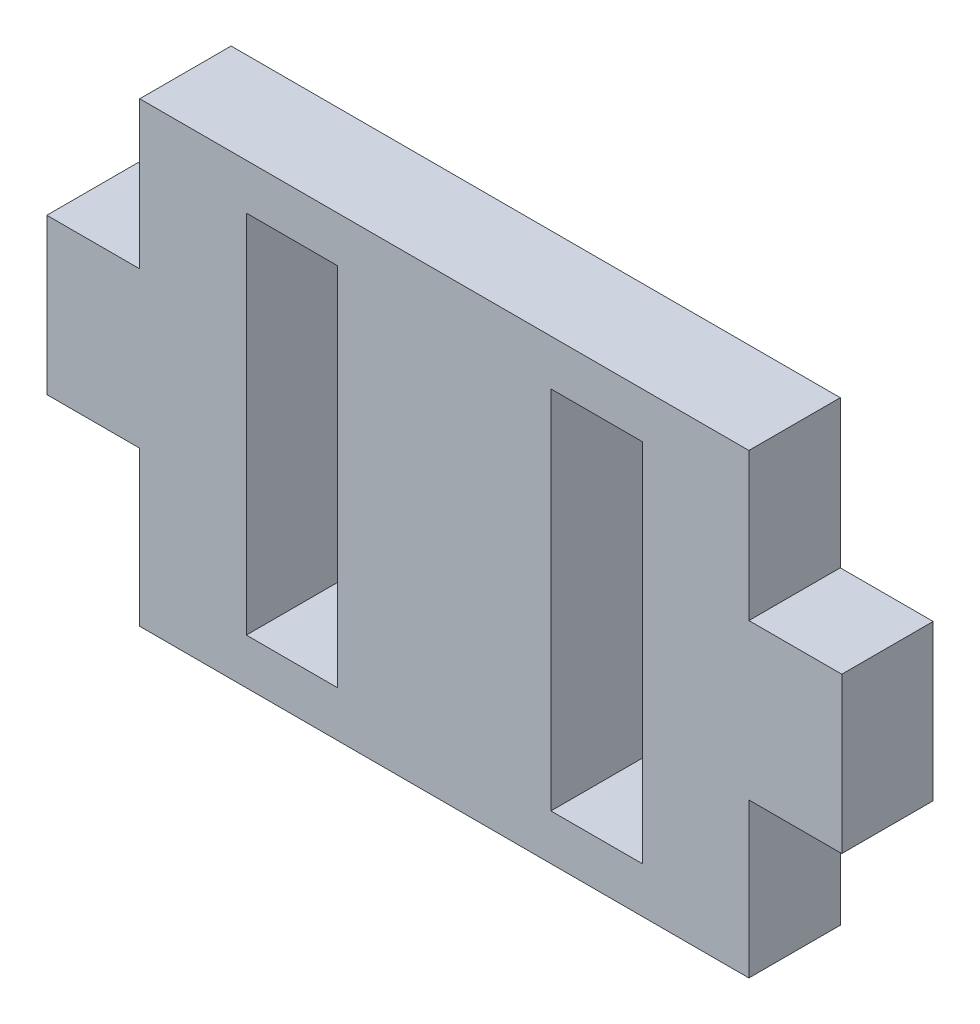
ISO-10303-21;
HEADER;
FILE_DESCRIPTION(('STEP AP214'),'2;1');
FILE_NAME('part.step','',(''),(''),'','','');
FILE_SCHEMA(('AUTOMOTIVE_DESIGN { 1 0 10303 214 1 1 1 1 }'));
ENDSEC;
DATA;
#1=APPLICATION_CONTEXT('core data for automotive mechanical design processes');
#2=APPLICATION_PROTOCOL_DEFINITION('international standard','automotive_design',2000,#1);
#3=PRODUCT_CONTEXT('',#1,'mechanical');
#4=PRODUCT('Part','Part','',(#3));
#5=PRODUCT_RELATED_PRODUCT_CATEGORY('part','',(#4));
#6=PRODUCT_DEFINITION_FORMATION('','',#4);
#7=PRODUCT_DEFINITION_CONTEXT('part definition',#1,'design');
#8=PRODUCT_DEFINITION('design','',#6,#7);
#9=PRODUCT_DEFINITION_SHAPE('','',#8);
#10=(LENGTH_UNIT() NAMED_UNIT(*) SI_UNIT(.MILLI.,.METRE.));
#11=(NAMED_UNIT(*) PLANE_ANGLE_UNIT() SI_UNIT($,.RADIAN.));
#12=(NAMED_UNIT(*) SI_UNIT($,.STERADIAN.) SOLID_ANGLE_UNIT());
#13=UNCERTAINTY_MEASURE_WITH_UNIT(LENGTH_MEASURE(1.E-05),#10,'distance_accuracy_value','');
#14=(GEOMETRIC_REPRESENTATION_CONTEXT(3) GLOBAL_UNCERTAINTY_ASSIGNED_CONTEXT((#13)) GLOBAL_UNIT_ASSIGNED_CONTEXT((#10,
#11,#12)) REPRESENTATION_CONTEXT('',''));
#15=CARTESIAN_POINT('',(0.,0.,0.));
#16=DIRECTION('',(0.,0.,1.));
#17=DIRECTION('',(1.,0.,0.));
#18=AXIS2_PLACEMENT_3D('',#15,#16,#17);
#19=CARTESIAN_POINT('',(0.,0.,6.));
#20=DIRECTION('',(0.,0.,-1.));
#21=DIRECTION('',(-1.,0.,0.));
#22=AXIS2_PLACEMENT_3D('',#19,#20,#21);
#23=PLANE('',#22);
#24=DIRECTION('',(0.,-1.,0.));
#25=VECTOR('',#24,1.);
#26=CARTESIAN_POINT('',(1.09006737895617,9.04398419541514,6.));
#27=LINE('',#26,#25);
#28=CARTESIAN_POINT('',(1.09006737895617,9.04398419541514,6.));
#29=VERTEX_POINT('',#28);
#30=CARTESIAN_POINT('',(1.09006737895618,-14.9560158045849,6.));
#31=VERTEX_POINT('',#30);
#32=EDGE_CURVE('E206',#29,#31,#27,.T.);
#33=ORIENTED_EDGE('',*,*,#32,.F.);
#34=DIRECTION('',(-1.,0.,0.));
#35=VECTOR('',#34,1.);
#36=CARTESIAN_POINT('',(1.09006737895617,9.04398419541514,6.));
#37=LINE('',#36,#35);
#38=CARTESIAN_POINT('',(7.09006737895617,9.04398419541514,6.));
#39=VERTEX_POINT('',#38);
#40=EDGE_CURVE('E214',#39,#29,#37,.T.);
#41=ORIENTED_EDGE('',*,*,#40,.F.);
#42=DIRECTION('',(0.,1.,0.));
#43=VECTOR('',#42,1.);
#44=CARTESIAN_POINT('',(7.09006737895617,9.04398419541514,6.));
#45=LINE('',#44,#43);
#46=CARTESIAN_POINT('',(7.09006737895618,-14.9560158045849,6.));
#47=VERTEX_POINT('',#46);
#48=EDGE_CURVE('E211',#47,#39,#45,.T.);
#49=ORIENTED_EDGE('',*,*,#48,.F.);
#50=DIRECTION('',(1.,0.,0.));
#51=VECTOR('',#50,1.);
#52=CARTESIAN_POINT('',(1.09006737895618,-14.9560158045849,6.));
#53=LINE('',#52,#51);
#54=EDGE_CURVE('E208',#31,#47,#53,.T.);
#55=ORIENTED_EDGE('',*,*,#54,.F.);
#56=EDGE_LOOP('',(#33,#41,#49,#55));
#57=FACE_BOUND('',#56,.T.);
#58=DIRECTION('',(0.,-1.,0.));
#59=VECTOR('',#58,1.);
#60=CARTESIAN_POINT('',(-5.90993262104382,12.0439841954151,6.));
#61=LINE('',#60,#59);
#62=CARTESIAN_POINT('',(-5.90993262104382,12.0439841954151,6.));
#63=VERTEX_POINT('',#62);
#64=CARTESIAN_POINT('',(-5.90993262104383,2.37020213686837,6.));
#65=VERTEX_POINT('',#64);
#66=EDGE_CURVE('E237',#63,#65,#61,.T.);
#67=ORIENTED_EDGE('',*,*,#66,.T.);
#68=DIRECTION('',(-1.,0.,0.));
#69=VECTOR('',#68,1.);
#70=CARTESIAN_POINT('',(-5.90993262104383,2.37020213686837,6.));
#71=LINE('',#70,#69);
#72=CARTESIAN_POINT('',(-12.0099326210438,2.37020213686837,6.));
#73=VERTEX_POINT('',#72);
#74=EDGE_CURVE('E240',#65,#73,#71,.T.);
#75=ORIENTED_EDGE('',*,*,#74,.T.);
#76=DIRECTION('',(0.,-1.,0.));
#77=VECTOR('',#76,1.);
#78=CARTESIAN_POINT('',(-12.0099326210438,2.37020213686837,6.));
#79=LINE('',#78,#77);
#80=CARTESIAN_POINT('',(-12.0099326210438,-7.82979786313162,6.));
#81=VERTEX_POINT('',#80);
#82=EDGE_CURVE('E243',#73,#81,#79,.T.);
#83=ORIENTED_EDGE('',*,*,#82,.T.);
#84=DIRECTION('',(1.,0.,0.));
#85=VECTOR('',#84,1.);
#86=CARTESIAN_POINT('',(-12.0099326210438,-7.82979786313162,6.));
#87=LINE('',#86,#85);
#88=CARTESIAN_POINT('',(-5.90993262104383,-7.82979786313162,6.));
#89=VERTEX_POINT('',#88);
#90=EDGE_CURVE('E245',#81,#89,#87,.T.);
#91=ORIENTED_EDGE('',*,*,#90,.T.);
#92=DIRECTION('',(0.,-1.,0.));
#93=VECTOR('',#92,1.);
#94=CARTESIAN_POINT('',(-5.90993262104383,-7.82979786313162,6.));
#95=LINE('',#94,#93);
#96=CARTESIAN_POINT('',(-5.90993262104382,-17.9560158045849,6.));
#97=VERTEX_POINT('',#96);
#98=EDGE_CURVE('E247',#89,#97,#95,.T.);
#99=ORIENTED_EDGE('',*,*,#98,.T.);
#100=DIRECTION('',(1.,0.,0.));
#101=VECTOR('',#100,1.);
#102=CARTESIAN_POINT('',(-5.90993262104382,-17.9560158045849,6.));
#103=LINE('',#102,#101);
#104=CARTESIAN_POINT('',(34.0900673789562,-17.9560158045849,6.));
#105=VERTEX_POINT('',#104);
#106=EDGE_CURVE('E249',#97,#105,#103,.T.);
#107=ORIENTED_EDGE('',*,*,#106,.T.);
#108=DIRECTION('',(0.,1.,0.));
#109=VECTOR('',#108,1.);
#110=CARTESIAN_POINT('',(34.0900673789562,-7.82979786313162,6.));
#111=LINE('',#110,#109);
#112=CARTESIAN_POINT('',(34.0900673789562,-7.82979786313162,6.));
#113=VERTEX_POINT('',#112);
#114=EDGE_CURVE('E251',#105,#113,#111,.T.);
#115=ORIENTED_EDGE('',*,*,#114,.T.);
#116=DIRECTION('',(1.,0.,0.));
#117=VECTOR('',#116,1.);
#118=CARTESIAN_POINT('',(40.1900673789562,-7.82979786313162,6.));
#119=LINE('',#118,#117);
#120=CARTESIAN_POINT('',(40.1900673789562,-7.82979786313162,6.));
#121=VERTEX_POINT('',#120);
#122=EDGE_CURVE('E253',#113,#121,#119,.T.);
#123=ORIENTED_EDGE('',*,*,#122,.T.);
#124=DIRECTION('',(0.,1.,0.));
#125=VECTOR('',#124,1.);
#126=CARTESIAN_POINT('',(40.1900673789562,2.37020213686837,6.));
#127=LINE('',#126,#125);
#128=CARTESIAN_POINT('',(40.1900673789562,2.37020213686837,6.));
#129=VERTEX_POINT('',#128);
#130=EDGE_CURVE('E255',#121,#129,#127,.T.);
#131=ORIENTED_EDGE('',*,*,#130,.T.);
#132=DIRECTION('',(-1.,0.,0.));
#133=VECTOR('',#132,1.);
#134=CARTESIAN_POINT('',(34.0900673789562,2.37020213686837,6.));
#135=LINE('',#134,#133);
#136=CARTESIAN_POINT('',(34.0900673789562,2.37020213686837,6.));
#137=VERTEX_POINT('',#136);
#138=EDGE_CURVE('E257',#129,#137,#135,.T.);
#139=ORIENTED_EDGE('',*,*,#138,.T.);
#140=DIRECTION('',(0.,1.,0.));
#141=VECTOR('',#140,1.);
#142=CARTESIAN_POINT('',(34.0900673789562,12.0439841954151,6.));
#143=LINE('',#142,#141);
#144=CARTESIAN_POINT('',(34.0900673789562,12.0439841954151,6.));
#145=VERTEX_POINT('',#144);
#146=EDGE_CURVE('E259',#137,#145,#143,.T.);
#147=ORIENTED_EDGE('',*,*,#146,.T.);
#148=DIRECTION('',(-1.,0.,0.));
#149=VECTOR('',#148,1.);
#150=CARTESIAN_POINT('',(-5.90993262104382,12.0439841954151,6.));
#151=LINE('',#150,#149);
#152=EDGE_CURVE('E261',#145,#63,#151,.T.);
#153=ORIENTED_EDGE('',*,*,#152,.T.);
#154=EDGE_LOOP('',(#67,#75,#83,#91,#99,#107,#115,#123,#131,#139,#147,#153));
#155=FACE_BOUND('',#154,.T.);
#156=DIRECTION('',(0.,1.,0.));
#157=VECTOR('',#156,1.);
#158=CARTESIAN_POINT('',(27.0900673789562,9.04398419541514,6.));
#159=LINE('',#158,#157);
#160=CARTESIAN_POINT('',(27.0900673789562,-14.9560158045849,6.));
#161=VERTEX_POINT('',#160);
#162=CARTESIAN_POINT('',(27.0900673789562,9.04398419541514,6.));
#163=VERTEX_POINT('',#162);
#164=EDGE_CURVE('E170',#161,#163,#159,.T.);
#165=ORIENTED_EDGE('',*,*,#164,.F.);
#166=DIRECTION('',(1.,0.,0.));
#167=VECTOR('',#166,1.);
#168=CARTESIAN_POINT('',(27.0900673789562,-14.9560158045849,6.));
#169=LINE('',#168,#167);
#170=CARTESIAN_POINT('',(21.0900673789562,-14.9560158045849,6.));
#171=VERTEX_POINT('',#170);
#172=EDGE_CURVE('E192',#171,#161,#169,.T.);
#173=ORIENTED_EDGE('',*,*,#172,.F.);
#174=DIRECTION('',(0.,-1.,0.));
#175=VECTOR('',#174,1.);
#176=CARTESIAN_POINT('',(21.0900673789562,9.04398419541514,6.));
#177=LINE('',#176,#175);
#178=CARTESIAN_POINT('',(21.0900673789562,9.04398419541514,6.));
#179=VERTEX_POINT('',#178);
#180=EDGE_CURVE('E190',#179,#171,#177,.T.);
#181=ORIENTED_EDGE('',*,*,#180,.F.);
#182=DIRECTION('',(-1.,0.,0.));
#183=VECTOR('',#182,1.);
#184=CARTESIAN_POINT('',(27.0900673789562,9.04398419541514,6.));
#185=LINE('',#184,#183);
#186=EDGE_CURVE('E178',#163,#179,#185,.T.);
#187=ORIENTED_EDGE('',*,*,#186,.F.);
#188=EDGE_LOOP('',(#165,#173,#181,#187));
#189=FACE_BOUND('',#188,.T.);
#190=ADVANCED_FACE('F33',(#57,#155,#189),#23,.F.);
#191=CARTESIAN_POINT('',(0.,0.,0.));
#192=DIRECTION('',(0.,0.,-1.));
#193=DIRECTION('',(-1.,0.,0.));
#194=AXIS2_PLACEMENT_3D('',#191,#192,#193);
#195=PLANE('',#194);
#196=DIRECTION('',(0.,-1.,0.));
#197=VECTOR('',#196,1.);
#198=CARTESIAN_POINT('',(-5.90993262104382,12.0439841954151,0.));
#199=LINE('',#198,#197);
#200=CARTESIAN_POINT('',(-5.90993262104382,12.0439841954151,0.));
#201=VERTEX_POINT('',#200);
#202=CARTESIAN_POINT('',(-5.90993262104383,2.37020213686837,0.));
#203=VERTEX_POINT('',#202);
#204=EDGE_CURVE('E236',#201,#203,#199,.T.);
#205=ORIENTED_EDGE('',*,*,#204,.F.);
#206=DIRECTION('',(-1.,0.,0.));
#207=VECTOR('',#206,1.);
#208=CARTESIAN_POINT('',(-5.90993262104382,12.0439841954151,0.));
#209=LINE('',#208,#207);
#210=CARTESIAN_POINT('',(34.0900673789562,12.0439841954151,0.));
#211=VERTEX_POINT('',#210);
#212=EDGE_CURVE('E241',#211,#201,#209,.T.);
#213=ORIENTED_EDGE('',*,*,#212,.F.);
#214=DIRECTION('',(0.,1.,0.));
#215=VECTOR('',#214,1.);
#216=CARTESIAN_POINT('',(34.0900673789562,12.0439841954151,0.));
#217=LINE('',#216,#215);
#218=CARTESIAN_POINT('',(34.0900673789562,2.37020213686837,0.));
#219=VERTEX_POINT('',#218);
#220=EDGE_CURVE('E284',#219,#211,#217,.T.);
#221=ORIENTED_EDGE('',*,*,#220,.F.);
#222=DIRECTION('',(-1.,0.,0.));
#223=VECTOR('',#222,1.);
#224=CARTESIAN_POINT('',(34.0900673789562,2.37020213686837,0.));
#225=LINE('',#224,#223);
#226=CARTESIAN_POINT('',(40.1900673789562,2.37020213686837,0.));
#227=VERTEX_POINT('',#226);
#228=EDGE_CURVE('E282',#227,#219,#225,.T.);
#229=ORIENTED_EDGE('',*,*,#228,.F.);
#230=DIRECTION('',(0.,1.,0.));
#231=VECTOR('',#230,1.);
#232=CARTESIAN_POINT('',(40.1900673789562,2.37020213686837,0.));
#233=LINE('',#232,#231);
#234=CARTESIAN_POINT('',(40.1900673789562,-7.82979786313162,0.));
#235=VERTEX_POINT('',#234);
#236=EDGE_CURVE('E280',#235,#227,#233,.T.);
#237=ORIENTED_EDGE('',*,*,#236,.F.);
#238=DIRECTION('',(1.,0.,0.));
#239=VECTOR('',#238,1.);
#240=CARTESIAN_POINT('',(40.1900673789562,-7.82979786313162,0.));
#241=LINE('',#240,#239);
#242=CARTESIAN_POINT('',(34.0900673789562,-7.82979786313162,0.));
#243=VERTEX_POINT('',#242);
#244=EDGE_CURVE('E278',#243,#235,#241,.T.);
#245=ORIENTED_EDGE('',*,*,#244,.F.);
#246=DIRECTION('',(0.,1.,0.));
#247=VECTOR('',#246,1.);
#248=CARTESIAN_POINT('',(34.0900673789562,-7.82979786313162,0.));
#249=LINE('',#248,#247);
#250=CARTESIAN_POINT('',(34.0900673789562,-17.9560158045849,0.));
#251=VERTEX_POINT('',#250);
#252=EDGE_CURVE('E276',#251,#243,#249,.T.);
#253=ORIENTED_EDGE('',*,*,#252,.F.);
#254=DIRECTION('',(1.,0.,0.));
#255=VECTOR('',#254,1.);
#256=CARTESIAN_POINT('',(-5.90993262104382,-17.9560158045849,0.));
#257=LINE('',#256,#255);
#258=CARTESIAN_POINT('',(-5.90993262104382,-17.9560158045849,0.));
#259=VERTEX_POINT('',#258);
#260=EDGE_CURVE('E274',#259,#251,#257,.T.);
#261=ORIENTED_EDGE('',*,*,#260,.F.);
#262=DIRECTION('',(0.,-1.,0.));
#263=VECTOR('',#262,1.);
#264=CARTESIAN_POINT('',(-5.90993262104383,-7.82979786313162,0.));
#265=LINE('',#264,#263);
#266=CARTESIAN_POINT('',(-5.90993262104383,-7.82979786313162,0.));
#267=VERTEX_POINT('',#266);
#268=EDGE_CURVE('E272',#267,#259,#265,.T.);
#269=ORIENTED_EDGE('',*,*,#268,.F.);
#270=DIRECTION('',(1.,0.,0.));
#271=VECTOR('',#270,1.);
#272=CARTESIAN_POINT('',(-12.0099326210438,-7.82979786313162,0.));
#273=LINE('',#272,#271);
#274=CARTESIAN_POINT('',(-12.0099326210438,-7.82979786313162,0.));
#275=VERTEX_POINT('',#274);
#276=EDGE_CURVE('E270',#275,#267,#273,.T.);
#277=ORIENTED_EDGE('',*,*,#276,.F.);
#278=DIRECTION('',(0.,-1.,0.));
#279=VECTOR('',#278,1.);
#280=CARTESIAN_POINT('',(-12.0099326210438,2.37020213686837,0.));
#281=LINE('',#280,#279);
#282=CARTESIAN_POINT('',(-12.0099326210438,2.37020213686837,0.));
#283=VERTEX_POINT('',#282);
#284=EDGE_CURVE('E268',#283,#275,#281,.T.);
#285=ORIENTED_EDGE('',*,*,#284,.F.);
#286=DIRECTION('',(-1.,0.,0.));
#287=VECTOR('',#286,1.);
#288=CARTESIAN_POINT('',(-5.90993262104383,2.37020213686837,0.));
#289=LINE('',#288,#287);
#290=EDGE_CURVE('E266',#203,#283,#289,.T.);
#291=ORIENTED_EDGE('',*,*,#290,.F.);
#292=EDGE_LOOP('',(#205,#213,#221,#229,#237,#245,#253,#261,#269,#277,#285,#291));
#293=FACE_BOUND('',#292,.T.);
#294=DIRECTION('',(-1.,0.,0.));
#295=VECTOR('',#294,1.);
#296=CARTESIAN_POINT('',(1.09006737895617,9.04398419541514,0.));
#297=LINE('',#296,#295);
#298=CARTESIAN_POINT('',(7.09006737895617,9.04398419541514,0.));
#299=VERTEX_POINT('',#298);
#300=CARTESIAN_POINT('',(1.09006737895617,9.04398419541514,0.));
#301=VERTEX_POINT('',#300);
#302=EDGE_CURVE('E209',#299,#301,#297,.T.);
#303=ORIENTED_EDGE('',*,*,#302,.T.);
#304=DIRECTION('',(0.,-1.,0.));
#305=VECTOR('',#304,1.);
#306=CARTESIAN_POINT('',(1.09006737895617,9.04398419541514,0.));
#307=LINE('',#306,#305);
#308=CARTESIAN_POINT('',(1.09006737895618,-14.9560158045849,0.));
#309=VERTEX_POINT('',#308);
#310=EDGE_CURVE('E186',#301,#309,#307,.T.);
#311=ORIENTED_EDGE('',*,*,#310,.T.);
#312=DIRECTION('',(1.,0.,0.));
#313=VECTOR('',#312,1.);
#314=CARTESIAN_POINT('',(1.09006737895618,-14.9560158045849,0.));
#315=LINE('',#314,#313);
#316=CARTESIAN_POINT('',(7.09006737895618,-14.9560158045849,0.));
#317=VERTEX_POINT('',#316);
#318=EDGE_CURVE('E219',#309,#317,#315,.T.);
#319=ORIENTED_EDGE('',*,*,#318,.T.);
#320=DIRECTION('',(0.,1.,0.));
#321=VECTOR('',#320,1.);
#322=CARTESIAN_POINT('',(7.09006737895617,9.04398419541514,0.));
#323=LINE('',#322,#321);
#324=EDGE_CURVE('E222',#317,#299,#323,.T.);
#325=ORIENTED_EDGE('',*,*,#324,.T.);
#326=EDGE_LOOP('',(#303,#311,#319,#325));
#327=FACE_BOUND('',#326,.T.);
#328=DIRECTION('',(1.,0.,0.));
#329=VECTOR('',#328,1.);
#330=CARTESIAN_POINT('',(27.0900673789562,-14.9560158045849,0.));
#331=LINE('',#330,#329);
#332=CARTESIAN_POINT('',(21.0900673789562,-14.9560158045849,0.));
#333=VERTEX_POINT('',#332);
#334=CARTESIAN_POINT('',(27.0900673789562,-14.9560158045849,0.));
#335=VERTEX_POINT('',#334);
#336=EDGE_CURVE('E179',#333,#335,#331,.T.);
#337=ORIENTED_EDGE('',*,*,#336,.T.);
#338=DIRECTION('',(0.,1.,0.));
#339=VECTOR('',#338,1.);
#340=CARTESIAN_POINT('',(27.0900673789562,9.04398419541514,0.));
#341=LINE('',#340,#339);
#342=CARTESIAN_POINT('',(27.0900673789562,9.04398419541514,0.));
#343=VERTEX_POINT('',#342);
#344=EDGE_CURVE('E56',#335,#343,#341,.T.);
#345=ORIENTED_EDGE('',*,*,#344,.T.);
#346=DIRECTION('',(-1.,0.,0.));
#347=VECTOR('',#346,1.);
#348=CARTESIAN_POINT('',(27.0900673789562,9.04398419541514,0.));
#349=LINE('',#348,#347);
#350=CARTESIAN_POINT('',(21.0900673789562,9.04398419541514,0.));
#351=VERTEX_POINT('',#350);
#352=EDGE_CURVE('E185',#343,#351,#349,.T.);
#353=ORIENTED_EDGE('',*,*,#352,.T.);
#354=DIRECTION('',(0.,-1.,0.));
#355=VECTOR('',#354,1.);
#356=CARTESIAN_POINT('',(21.0900673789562,9.04398419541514,0.));
#357=LINE('',#356,#355);
#358=EDGE_CURVE('E198',#351,#333,#357,.T.);
#359=ORIENTED_EDGE('',*,*,#358,.T.);
#360=EDGE_LOOP('',(#337,#345,#353,#359));
#361=FACE_BOUND('',#360,.T.);
#362=ADVANCED_FACE('F326',(#293,#327,#361),#195,.T.);
#363=CARTESIAN_POINT('',(-5.90993262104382,12.0439841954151,6.));
#364=DIRECTION('',(1.,0.,0.));
#365=DIRECTION('',(0.,1.,0.));
#366=AXIS2_PLACEMENT_3D('',#363,#364,#365);
#367=PLANE('',#366);
#368=ORIENTED_EDGE('',*,*,#204,.T.);
#369=DIRECTION('',(0.,0.,-1.));
#370=VECTOR('',#369,1.);
#371=CARTESIAN_POINT('',(-5.90993262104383,2.37020213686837,6.));
#372=LINE('',#371,#370);
#373=EDGE_CURVE('E11',#65,#203,#372,.T.);
#374=ORIENTED_EDGE('',*,*,#373,.F.);
#375=ORIENTED_EDGE('',*,*,#66,.F.);
#376=DIRECTION('',(0.,0.,-1.));
#377=VECTOR('',#376,1.);
#378=CARTESIAN_POINT('',(-5.90993262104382,12.0439841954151,6.));
#379=LINE('',#378,#377);
#380=EDGE_CURVE('E263',#63,#201,#379,.T.);
#381=ORIENTED_EDGE('',*,*,#380,.T.);
#382=EDGE_LOOP('',(#368,#374,#375,#381));
#383=FACE_BOUND('',#382,.T.);
#384=ADVANCED_FACE('F35',(#383),#367,.F.);
#385=CARTESIAN_POINT('',(-5.90993262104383,2.37020213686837,6.));
#386=DIRECTION('',(0.,-1.,0.));
#387=DIRECTION('',(1.,0.,0.));
#388=AXIS2_PLACEMENT_3D('',#385,#386,#387);
#389=PLANE('',#388);
#390=ORIENTED_EDGE('',*,*,#290,.T.);
#391=DIRECTION('',(0.,0.,-1.));
#392=VECTOR('',#391,1.);
#393=CARTESIAN_POINT('',(-12.0099326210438,2.37020213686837,6.));
#394=LINE('',#393,#392);
#395=EDGE_CURVE('E41',#73,#283,#394,.T.);
#396=ORIENTED_EDGE('',*,*,#395,.F.);
#397=ORIENTED_EDGE('',*,*,#74,.F.);
#398=ORIENTED_EDGE('',*,*,#373,.T.);
#399=EDGE_LOOP('',(#390,#396,#397,#398));
#400=FACE_BOUND('',#399,.T.);
#401=ADVANCED_FACE('F343',(#400),#389,.F.);
#402=CARTESIAN_POINT('',(-12.0099326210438,2.37020213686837,6.));
#403=DIRECTION('',(1.,0.,0.));
#404=DIRECTION('',(0.,1.,0.));
#405=AXIS2_PLACEMENT_3D('',#402,#403,#404);
#406=PLANE('',#405);
#407=ORIENTED_EDGE('',*,*,#284,.T.);
#408=DIRECTION('',(0.,0.,-1.));
#409=VECTOR('',#408,1.);
#410=CARTESIAN_POINT('',(-12.0099326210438,-7.82979786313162,6.));
#411=LINE('',#410,#409);
#412=EDGE_CURVE('E313',#81,#275,#411,.T.);
#413=ORIENTED_EDGE('',*,*,#412,.F.);
#414=ORIENTED_EDGE('',*,*,#82,.F.);
#415=ORIENTED_EDGE('',*,*,#395,.T.);
#416=EDGE_LOOP('',(#407,#413,#414,#415));
#417=FACE_BOUND('',#416,.T.);
#418=ADVANCED_FACE('F320',(#417),#406,.F.);
#419=CARTESIAN_POINT('',(-12.0099326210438,-7.82979786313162,6.));
#420=DIRECTION('',(0.,1.,0.));
#421=DIRECTION('',(0.,0.,1.));
#422=AXIS2_PLACEMENT_3D('',#419,#420,#421);
#423=PLANE('',#422);
#424=ORIENTED_EDGE('',*,*,#276,.T.);
#425=DIRECTION('',(0.,0.,-1.));
#426=VECTOR('',#425,1.);
#427=CARTESIAN_POINT('',(-5.90993262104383,-7.82979786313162,6.));
#428=LINE('',#427,#426);
#429=EDGE_CURVE('E310',#89,#267,#428,.T.);
#430=ORIENTED_EDGE('',*,*,#429,.F.);
#431=ORIENTED_EDGE('',*,*,#90,.F.);
#432=ORIENTED_EDGE('',*,*,#412,.T.);
#433=EDGE_LOOP('',(#424,#430,#431,#432));
#434=FACE_BOUND('',#433,.T.);
#435=ADVANCED_FACE('F332',(#434),#423,.F.);
#436=CARTESIAN_POINT('',(-5.90993262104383,-7.82979786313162,6.));
#437=DIRECTION('',(1.,0.,0.));
#438=DIRECTION('',(0.,1.,0.));
#439=AXIS2_PLACEMENT_3D('',#436,#437,#438);
#440=PLANE('',#439);
#441=ORIENTED_EDGE('',*,*,#268,.T.);
#442=DIRECTION('',(0.,0.,-1.));
#443=VECTOR('',#442,1.);
#444=CARTESIAN_POINT('',(-5.90993262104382,-17.9560158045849,6.));
#445=LINE('',#444,#443);
#446=EDGE_CURVE('E307',#97,#259,#445,.T.);
#447=ORIENTED_EDGE('',*,*,#446,.F.);
#448=ORIENTED_EDGE('',*,*,#98,.F.);
#449=ORIENTED_EDGE('',*,*,#429,.T.);
#450=EDGE_LOOP('',(#441,#447,#448,#449));
#451=FACE_BOUND('',#450,.T.);
#452=ADVANCED_FACE('F336',(#451),#440,.F.);
#453=CARTESIAN_POINT('',(-5.90993262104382,-17.9560158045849,6.));
#454=DIRECTION('',(0.,1.,0.));
#455=DIRECTION('',(0.,0.,1.));
#456=AXIS2_PLACEMENT_3D('',#453,#454,#455);
#457=PLANE('',#456);
#458=ORIENTED_EDGE('',*,*,#260,.T.);
#459=DIRECTION('',(0.,0.,-1.));
#460=VECTOR('',#459,1.);
#461=CARTESIAN_POINT('',(34.0900673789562,-17.9560158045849,6.));
#462=LINE('',#461,#460);
#463=EDGE_CURVE('E304',#105,#251,#462,.T.);
#464=ORIENTED_EDGE('',*,*,#463,.F.);
#465=ORIENTED_EDGE('',*,*,#106,.F.);
#466=ORIENTED_EDGE('',*,*,#446,.T.);
#467=EDGE_LOOP('',(#458,#464,#465,#466));
#468=FACE_BOUND('',#467,.T.);
#469=ADVANCED_FACE('F376',(#468),#457,.F.);
#470=CARTESIAN_POINT('',(34.0900673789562,-7.82979786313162,6.));
#471=DIRECTION('',(-1.,0.,0.));
#472=DIRECTION('',(0.,-1.,0.));
#473=AXIS2_PLACEMENT_3D('',#470,#471,#472);
#474=PLANE('',#473);
#475=ORIENTED_EDGE('',*,*,#252,.T.);
#476=DIRECTION('',(0.,0.,-1.));
#477=VECTOR('',#476,1.);
#478=CARTESIAN_POINT('',(34.0900673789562,-7.82979786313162,6.));
#479=LINE('',#478,#477);
#480=EDGE_CURVE('E301',#113,#243,#479,.T.);
#481=ORIENTED_EDGE('',*,*,#480,.F.);
#482=ORIENTED_EDGE('',*,*,#114,.F.);
#483=ORIENTED_EDGE('',*,*,#463,.T.);
#484=EDGE_LOOP('',(#475,#481,#482,#483));
#485=FACE_BOUND('',#484,.T.);
#486=ADVANCED_FACE('F374',(#485),#474,.F.);
#487=CARTESIAN_POINT('',(40.1900673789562,-7.82979786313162,6.));
#488=DIRECTION('',(0.,1.,0.));
#489=DIRECTION('',(0.,0.,1.));
#490=AXIS2_PLACEMENT_3D('',#487,#488,#489);
#491=PLANE('',#490);
#492=ORIENTED_EDGE('',*,*,#244,.T.);
#493=DIRECTION('',(0.,0.,-1.));
#494=VECTOR('',#493,1.);
#495=CARTESIAN_POINT('',(40.1900673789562,-7.82979786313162,6.));
#496=LINE('',#495,#494);
#497=EDGE_CURVE('E298',#121,#235,#496,.T.);
#498=ORIENTED_EDGE('',*,*,#497,.F.);
#499=ORIENTED_EDGE('',*,*,#122,.F.);
#500=ORIENTED_EDGE('',*,*,#480,.T.);
#501=EDGE_LOOP('',(#492,#498,#499,#500));
#502=FACE_BOUND('',#501,.T.);
#503=ADVANCED_FACE('F370',(#502),#491,.F.);
#504=CARTESIAN_POINT('',(40.1900673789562,2.37020213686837,6.));
#505=DIRECTION('',(-1.,0.,0.));
#506=DIRECTION('',(0.,-1.,0.));
#507=AXIS2_PLACEMENT_3D('',#504,#505,#506);
#508=PLANE('',#507);
#509=ORIENTED_EDGE('',*,*,#236,.T.);
#510=DIRECTION('',(0.,0.,-1.));
#511=VECTOR('',#510,1.);
#512=CARTESIAN_POINT('',(40.1900673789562,2.37020213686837,6.));
#513=LINE('',#512,#511);
#514=EDGE_CURVE('E295',#129,#227,#513,.T.);
#515=ORIENTED_EDGE('',*,*,#514,.F.);
#516=ORIENTED_EDGE('',*,*,#130,.F.);
#517=ORIENTED_EDGE('',*,*,#497,.T.);
#518=EDGE_LOOP('',(#509,#515,#516,#517));
#519=FACE_BOUND('',#518,.T.);
#520=ADVANCED_FACE('F365',(#519),#508,.F.);
#521=CARTESIAN_POINT('',(34.0900673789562,2.37020213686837,6.));
#522=DIRECTION('',(0.,-1.,0.));
#523=DIRECTION('',(1.,0.,0.));
#524=AXIS2_PLACEMENT_3D('',#521,#522,#523);
#525=PLANE('',#524);
#526=ORIENTED_EDGE('',*,*,#228,.T.);
#527=DIRECTION('',(0.,0.,-1.));
#528=VECTOR('',#527,1.);
#529=CARTESIAN_POINT('',(34.0900673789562,2.37020213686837,6.));
#530=LINE('',#529,#528);
#531=EDGE_CURVE('E292',#137,#219,#530,.T.);
#532=ORIENTED_EDGE('',*,*,#531,.F.);
#533=ORIENTED_EDGE('',*,*,#138,.F.);
#534=ORIENTED_EDGE('',*,*,#514,.T.);
#535=EDGE_LOOP('',(#526,#532,#533,#534));
#536=FACE_BOUND('',#535,.T.);
#537=ADVANCED_FACE('F359',(#536),#525,.F.);
#538=CARTESIAN_POINT('',(34.0900673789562,12.0439841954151,6.));
#539=DIRECTION('',(-1.,0.,0.));
#540=DIRECTION('',(0.,-1.,0.));
#541=AXIS2_PLACEMENT_3D('',#538,#539,#540);
#542=PLANE('',#541);
#543=ORIENTED_EDGE('',*,*,#220,.T.);
#544=DIRECTION('',(0.,0.,-1.));
#545=VECTOR('',#544,1.);
#546=CARTESIAN_POINT('',(34.0900673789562,12.0439841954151,6.));
#547=LINE('',#546,#545);
#548=EDGE_CURVE('E289',#145,#211,#547,.T.);
#549=ORIENTED_EDGE('',*,*,#548,.F.);
#550=ORIENTED_EDGE('',*,*,#146,.F.);
#551=ORIENTED_EDGE('',*,*,#531,.T.);
#552=EDGE_LOOP('',(#543,#549,#550,#551));
#553=FACE_BOUND('',#552,.T.);
#554=ADVANCED_FACE('F355',(#553),#542,.F.);
#555=CARTESIAN_POINT('',(-5.90993262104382,12.0439841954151,6.));
#556=DIRECTION('',(0.,-1.,0.));
#557=DIRECTION('',(1.,0.,0.));
#558=AXIS2_PLACEMENT_3D('',#555,#556,#557);
#559=PLANE('',#558);
#560=ORIENTED_EDGE('',*,*,#212,.T.);
#561=ORIENTED_EDGE('',*,*,#380,.F.);
#562=ORIENTED_EDGE('',*,*,#152,.F.);
#563=ORIENTED_EDGE('',*,*,#548,.T.);
#564=EDGE_LOOP('',(#560,#561,#562,#563));
#565=FACE_BOUND('',#564,.T.);
#566=ADVANCED_FACE('F350',(#565),#559,.F.);
#567=CARTESIAN_POINT('',(1.09006737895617,9.04398419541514,6.));
#568=DIRECTION('',(1.,0.,0.));
#569=DIRECTION('',(0.,1.,0.));
#570=AXIS2_PLACEMENT_3D('',#567,#568,#569);
#571=PLANE('',#570);
#572=ORIENTED_EDGE('',*,*,#310,.F.);
#573=DIRECTION('',(0.,0.,-1.));
#574=VECTOR('',#573,1.);
#575=CARTESIAN_POINT('',(1.09006737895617,9.04398419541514,6.));
#576=LINE('',#575,#574);
#577=EDGE_CURVE('E216',#29,#301,#576,.T.);
#578=ORIENTED_EDGE('',*,*,#577,.F.);
#579=ORIENTED_EDGE('',*,*,#32,.T.);
#580=DIRECTION('',(0.,0.,-1.));
#581=VECTOR('',#580,1.);
#582=CARTESIAN_POINT('',(1.09006737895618,-14.9560158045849,6.));
#583=LINE('',#582,#581);
#584=EDGE_CURVE('E233',#31,#309,#583,.T.);
#585=ORIENTED_EDGE('',*,*,#584,.T.);
#586=EDGE_LOOP('',(#572,#578,#579,#585));
#587=FACE_BOUND('',#586,.T.);
#588=ADVANCED_FACE('F394',(#587),#571,.T.);
#589=CARTESIAN_POINT('',(1.09006737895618,-14.9560158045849,6.));
#590=DIRECTION('',(0.,1.,0.));
#591=DIRECTION('',(0.,0.,1.));
#592=AXIS2_PLACEMENT_3D('',#589,#590,#591);
#593=PLANE('',#592);
#594=ORIENTED_EDGE('',*,*,#318,.F.);
#595=ORIENTED_EDGE('',*,*,#584,.F.);
#596=ORIENTED_EDGE('',*,*,#54,.T.);
#597=DIRECTION('',(0.,0.,-1.));
#598=VECTOR('',#597,1.);
#599=CARTESIAN_POINT('',(7.09006737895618,-14.9560158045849,6.));
#600=LINE('',#599,#598);
#601=EDGE_CURVE('E231',#47,#317,#600,.T.);
#602=ORIENTED_EDGE('',*,*,#601,.T.);
#603=EDGE_LOOP('',(#594,#595,#596,#602));
#604=FACE_BOUND('',#603,.T.);
#605=ADVANCED_FACE('F432',(#604),#593,.T.);
#606=CARTESIAN_POINT('',(7.09006737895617,9.04398419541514,6.));
#607=DIRECTION('',(-1.,0.,0.));
#608=DIRECTION('',(0.,-1.,0.));
#609=AXIS2_PLACEMENT_3D('',#606,#607,#608);
#610=PLANE('',#609);
#611=ORIENTED_EDGE('',*,*,#324,.F.);
#612=ORIENTED_EDGE('',*,*,#601,.F.);
#613=ORIENTED_EDGE('',*,*,#48,.T.);
#614=DIRECTION('',(0.,0.,-1.));
#615=VECTOR('',#614,1.);
#616=CARTESIAN_POINT('',(7.09006737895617,9.04398419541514,6.));
#617=LINE('',#616,#615);
#618=EDGE_CURVE('E229',#39,#299,#617,.T.);
#619=ORIENTED_EDGE('',*,*,#618,.T.);
#620=EDGE_LOOP('',(#611,#612,#613,#619));
#621=FACE_BOUND('',#620,.T.);
#622=ADVANCED_FACE('F439',(#621),#610,.T.);
#623=CARTESIAN_POINT('',(1.09006737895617,9.04398419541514,6.));
#624=DIRECTION('',(0.,-1.,0.));
#625=DIRECTION('',(0.,0.,-1.));
#626=AXIS2_PLACEMENT_3D('',#623,#624,#625);
#627=PLANE('',#626);
#628=ORIENTED_EDGE('',*,*,#302,.F.);
#629=ORIENTED_EDGE('',*,*,#618,.F.);
#630=ORIENTED_EDGE('',*,*,#40,.T.);
#631=ORIENTED_EDGE('',*,*,#577,.T.);
#632=EDGE_LOOP('',(#628,#629,#630,#631));
#633=FACE_BOUND('',#632,.T.);
#634=ADVANCED_FACE('F446',(#633),#627,.T.);
#635=CARTESIAN_POINT('',(27.0900673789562,9.04398419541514,6.));
#636=DIRECTION('',(-1.,0.,0.));
#637=DIRECTION('',(0.,-1.,0.));
#638=AXIS2_PLACEMENT_3D('',#635,#636,#637);
#639=PLANE('',#638);
#640=ORIENTED_EDGE('',*,*,#344,.F.);
#641=DIRECTION('',(0.,0.,-1.));
#642=VECTOR('',#641,1.);
#643=CARTESIAN_POINT('',(27.0900673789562,-14.9560158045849,6.));
#644=LINE('',#643,#642);
#645=EDGE_CURVE('E174',#161,#335,#644,.T.);
#646=ORIENTED_EDGE('',*,*,#645,.F.);
#647=ORIENTED_EDGE('',*,*,#164,.T.);
#648=DIRECTION('',(0.,0.,-1.));
#649=VECTOR('',#648,1.);
#650=CARTESIAN_POINT('',(27.0900673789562,9.04398419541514,6.));
#651=LINE('',#650,#649);
#652=EDGE_CURVE('E173',#163,#343,#651,.T.);
#653=ORIENTED_EDGE('',*,*,#652,.T.);
#654=EDGE_LOOP('',(#640,#646,#647,#653));
#655=FACE_BOUND('',#654,.T.);
#656=ADVANCED_FACE('F172',(#655),#639,.T.);
#657=CARTESIAN_POINT('',(27.0900673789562,9.04398419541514,6.));
#658=DIRECTION('',(0.,-1.,0.));
#659=DIRECTION('',(0.,0.,-1.));
#660=AXIS2_PLACEMENT_3D('',#657,#658,#659);
#661=PLANE('',#660);
#662=ORIENTED_EDGE('',*,*,#352,.F.);
#663=ORIENTED_EDGE('',*,*,#652,.F.);
#664=ORIENTED_EDGE('',*,*,#186,.T.);
#665=DIRECTION('',(0.,0.,-1.));
#666=VECTOR('',#665,1.);
#667=CARTESIAN_POINT('',(21.0900673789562,9.04398419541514,6.));
#668=LINE('',#667,#666);
#669=EDGE_CURVE('E187',#179,#351,#668,.T.);
#670=ORIENTED_EDGE('',*,*,#669,.T.);
#671=EDGE_LOOP('',(#662,#663,#664,#670));
#672=FACE_BOUND('',#671,.T.);
#673=ADVANCED_FACE('F182',(#672),#661,.T.);
#674=CARTESIAN_POINT('',(21.0900673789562,9.04398419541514,6.));
#675=DIRECTION('',(1.,0.,0.));
#676=DIRECTION('',(0.,1.,0.));
#677=AXIS2_PLACEMENT_3D('',#674,#675,#676);
#678=PLANE('',#677);
#679=ORIENTED_EDGE('',*,*,#358,.F.);
#680=ORIENTED_EDGE('',*,*,#669,.F.);
#681=ORIENTED_EDGE('',*,*,#180,.T.);
#682=DIRECTION('',(0.,0.,-1.));
#683=VECTOR('',#682,1.);
#684=CARTESIAN_POINT('',(21.0900673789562,-14.9560158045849,6.));
#685=LINE('',#684,#683);
#686=EDGE_CURVE('E48',#171,#333,#685,.T.);
#687=ORIENTED_EDGE('',*,*,#686,.T.);
#688=EDGE_LOOP('',(#679,#680,#681,#687));
#689=FACE_BOUND('',#688,.T.);
#690=ADVANCED_FACE('F467',(#689),#678,.T.);
#691=CARTESIAN_POINT('',(27.0900673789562,-14.9560158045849,6.));
#692=DIRECTION('',(0.,1.,0.));
#693=DIRECTION('',(0.,0.,1.));
#694=AXIS2_PLACEMENT_3D('',#691,#692,#693);
#695=PLANE('',#694);
#696=ORIENTED_EDGE('',*,*,#336,.F.);
#697=ORIENTED_EDGE('',*,*,#686,.F.);
#698=ORIENTED_EDGE('',*,*,#172,.T.);
#699=ORIENTED_EDGE('',*,*,#645,.T.);
#700=EDGE_LOOP('',(#696,#697,#698,#699));
#701=FACE_BOUND('',#700,.T.);
#702=ADVANCED_FACE('F474',(#701),#695,.T.);
#703=CLOSED_SHELL('',(#190,#362,#384,#401,#418,#435,#452,#469,#486,#503,#520,#537,#554,#566,
#588,#605,#622,#634,#656,#673,#690,#702));
#704=MANIFOLD_SOLID_BREP('B2',#703);
#705=ADVANCED_BREP_SHAPE_REPRESENTATION('',(#18,#704),#14);
#706=SHAPE_DEFINITION_REPRESENTATION(#9,#705);
ENDSEC;
END-ISO-10303-21;
